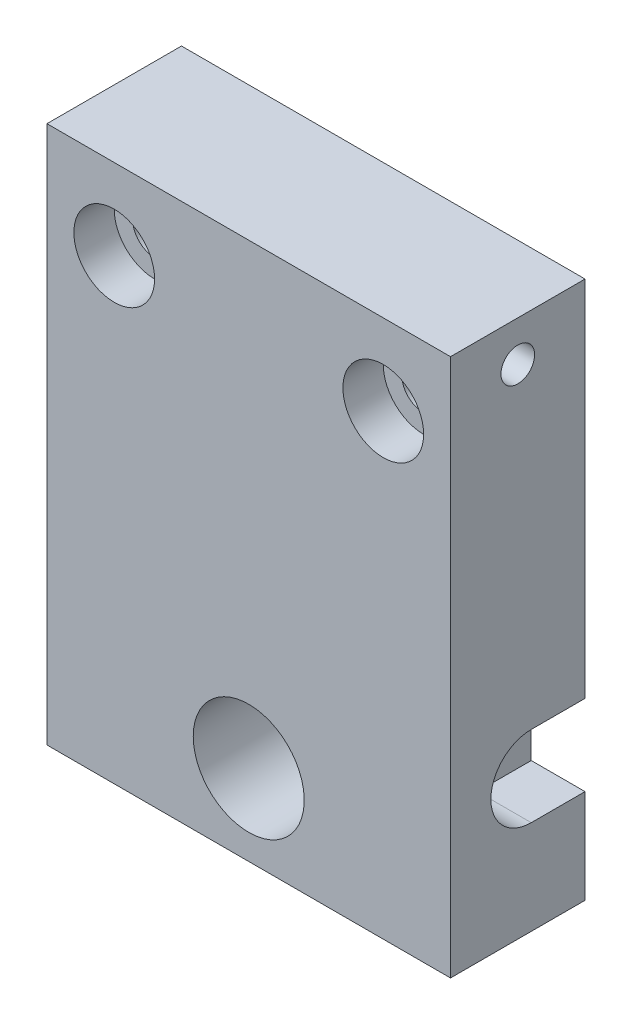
ISO-10303-21;
HEADER;
FILE_DESCRIPTION(('STEP AP214'),'2;1');
FILE_NAME('part.step','',(''),(''),'','','');
FILE_SCHEMA(('AUTOMOTIVE_DESIGN { 1 0 10303 214 1 1 1 1 }'));
ENDSEC;
DATA;
#1=APPLICATION_CONTEXT('core data for automotive mechanical design processes');
#2=APPLICATION_PROTOCOL_DEFINITION('international standard','automotive_design',2000,#1);
#3=PRODUCT_CONTEXT('',#1,'mechanical');
#4=PRODUCT('Part','Part','',(#3));
#5=PRODUCT_RELATED_PRODUCT_CATEGORY('part','',(#4));
#6=PRODUCT_DEFINITION_FORMATION('','',#4);
#7=PRODUCT_DEFINITION_CONTEXT('part definition',#1,'design');
#8=PRODUCT_DEFINITION('design','',#6,#7);
#9=PRODUCT_DEFINITION_SHAPE('','',#8);
#10=(LENGTH_UNIT() NAMED_UNIT(*) SI_UNIT(.MILLI.,.METRE.));
#11=(NAMED_UNIT(*) PLANE_ANGLE_UNIT() SI_UNIT($,.RADIAN.));
#12=(NAMED_UNIT(*) SI_UNIT($,.STERADIAN.) SOLID_ANGLE_UNIT());
#13=UNCERTAINTY_MEASURE_WITH_UNIT(LENGTH_MEASURE(1.E-05),#10,'distance_accuracy_value','');
#14=(GEOMETRIC_REPRESENTATION_CONTEXT(3) GLOBAL_UNCERTAINTY_ASSIGNED_CONTEXT((#13)) GLOBAL_UNIT_ASSIGNED_CONTEXT((#10,
#11,#12)) REPRESENTATION_CONTEXT('',''));
#15=CARTESIAN_POINT('',(0.,0.,0.));
#16=DIRECTION('',(0.,0.,1.));
#17=DIRECTION('',(1.,0.,0.));
#18=AXIS2_PLACEMENT_3D('',#15,#16,#17);
#19=CARTESIAN_POINT('',(-30.,80.,-4.71844785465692E-13));
#20=DIRECTION('',(1.,0.,0.));
#21=DIRECTION('',(0.,0.,-1.));
#22=AXIS2_PLACEMENT_3D('',#19,#20,#21);
#23=PLANE('',#22);
#24=CARTESIAN_POINT('',(-30.,74.,-10.0000000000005));
#25=DIRECTION('',(-1.,0.,0.));
#26=DIRECTION('',(0.,0.,1.));
#27=AXIS2_PLACEMENT_3D('',#24,#25,#26);
#28=CIRCLE('',#27,2.49999999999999);
#29=CARTESIAN_POINT('',(-30.,74.,-7.50000000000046));
#30=VERTEX_POINT('',#29);
#31=EDGE_CURVE('E169',#30,#30,#28,.T.);
#32=ORIENTED_EDGE('',*,*,#31,.F.);
#33=EDGE_LOOP('',(#32));
#34=FACE_BOUND('',#33,.T.);
#35=DIRECTION('',(0.,0.,1.));
#36=VECTOR('',#35,1.);
#37=CARTESIAN_POINT('',(-30.,0.,0.));
#38=LINE('',#37,#36);
#39=CARTESIAN_POINT('',(-30.,0.,-20.));
#40=VERTEX_POINT('',#39);
#41=CARTESIAN_POINT('',(-30.,0.,0.));
#42=VERTEX_POINT('',#41);
#43=EDGE_CURVE('E213',#40,#42,#38,.T.);
#44=ORIENTED_EDGE('',*,*,#43,.T.);
#45=DIRECTION('',(0.,-1.,0.));
#46=VECTOR('',#45,1.);
#47=CARTESIAN_POINT('',(-30.,80.,-4.71844785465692E-13));
#48=LINE('',#47,#46);
#49=CARTESIAN_POINT('',(-30.,80.,-4.71844785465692E-13));
#50=VERTEX_POINT('',#49);
#51=EDGE_CURVE('E11',#50,#42,#48,.T.);
#52=ORIENTED_EDGE('',*,*,#51,.F.);
#53=DIRECTION('',(0.,0.,1.));
#54=VECTOR('',#53,1.);
#55=CARTESIAN_POINT('',(-30.,80.,-4.71844785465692E-13));
#56=LINE('',#55,#54);
#57=CARTESIAN_POINT('',(-30.,80.,-20.));
#58=VERTEX_POINT('',#57);
#59=EDGE_CURVE('E226',#58,#50,#56,.T.);
#60=ORIENTED_EDGE('',*,*,#59,.F.);
#61=DIRECTION('',(0.,-1.,0.));
#62=VECTOR('',#61,1.);
#63=CARTESIAN_POINT('',(-30.,80.,-20.));
#64=LINE('',#63,#62);
#65=EDGE_CURVE('E237',#58,#40,#64,.T.);
#66=ORIENTED_EDGE('',*,*,#65,.T.);
#67=EDGE_LOOP('',(#44,#52,#60,#66));
#68=FACE_BOUND('',#67,.T.);
#69=ADVANCED_FACE('F42',(#34,#68),#23,.F.);
#70=CARTESIAN_POINT('',(-30.,80.,-4.71844785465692E-13));
#71=DIRECTION('',(0.,0.,-1.));
#72=DIRECTION('',(-1.,0.,0.));
#73=AXIS2_PLACEMENT_3D('',#70,#71,#72);
#74=PLANE('',#73);
#75=CARTESIAN_POINT('',(0.,12.,0.));
#76=DIRECTION('',(0.,0.,-1.));
#77=DIRECTION('',(-1.,0.,0.));
#78=AXIS2_PLACEMENT_3D('',#75,#76,#77);
#79=CIRCLE('',#78,8.24999999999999);
#80=CARTESIAN_POINT('',(-8.24999999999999,12.,0.));
#81=VERTEX_POINT('',#80);
#82=EDGE_CURVE('E133',#81,#81,#79,.T.);
#83=ORIENTED_EDGE('',*,*,#82,.T.);
#84=EDGE_LOOP('',(#83));
#85=FACE_BOUND('',#84,.T.);
#86=CARTESIAN_POINT('',(-20.,67.9999999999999,0.));
#87=DIRECTION('',(0.,0.,1.));
#88=DIRECTION('',(1.,0.,0.));
#89=AXIS2_PLACEMENT_3D('',#86,#87,#88);
#90=CIRCLE('',#89,5.99999999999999);
#91=CARTESIAN_POINT('',(-14.,67.9999999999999,0.));
#92=VERTEX_POINT('',#91);
#93=EDGE_CURVE('E181',#92,#92,#90,.T.);
#94=ORIENTED_EDGE('',*,*,#93,.F.);
#95=EDGE_LOOP('',(#94));
#96=FACE_BOUND('',#95,.T.);
#97=CARTESIAN_POINT('',(20.,67.9999999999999,0.));
#98=DIRECTION('',(0.,0.,1.));
#99=DIRECTION('',(1.,0.,0.));
#100=AXIS2_PLACEMENT_3D('',#97,#98,#99);
#101=CIRCLE('',#100,5.99999999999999);
#102=CARTESIAN_POINT('',(26.,67.9999999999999,0.));
#103=VERTEX_POINT('',#102);
#104=EDGE_CURVE('E197',#103,#103,#101,.T.);
#105=ORIENTED_EDGE('',*,*,#104,.F.);
#106=EDGE_LOOP('',(#105));
#107=FACE_BOUND('',#106,.T.);
#108=DIRECTION('',(1.,0.,0.));
#109=VECTOR('',#108,1.);
#110=CARTESIAN_POINT('',(-30.,0.,0.));
#111=LINE('',#110,#109);
#112=CARTESIAN_POINT('',(29.9999999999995,0.,0.));
#113=VERTEX_POINT('',#112);
#114=EDGE_CURVE('E217',#42,#113,#111,.T.);
#115=ORIENTED_EDGE('',*,*,#114,.T.);
#116=DIRECTION('',(0.,-1.,0.));
#117=VECTOR('',#116,1.);
#118=CARTESIAN_POINT('',(30.,80.,0.));
#119=LINE('',#118,#117);
#120=CARTESIAN_POINT('',(30.,80.,0.));
#121=VERTEX_POINT('',#120);
#122=EDGE_CURVE('E50',#121,#113,#119,.T.);
#123=ORIENTED_EDGE('',*,*,#122,.F.);
#124=DIRECTION('',(1.,0.,0.));
#125=VECTOR('',#124,1.);
#126=CARTESIAN_POINT('',(-30.,80.,-4.71844785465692E-13));
#127=LINE('',#126,#125);
#128=EDGE_CURVE('E229',#50,#121,#127,.T.);
#129=ORIENTED_EDGE('',*,*,#128,.F.);
#130=ORIENTED_EDGE('',*,*,#51,.T.);
#131=EDGE_LOOP('',(#115,#123,#129,#130));
#132=FACE_BOUND('',#131,.T.);
#133=ADVANCED_FACE('F262',(#85,#96,#107,#132),#74,.F.);
#134=CARTESIAN_POINT('',(30.,80.,0.));
#135=DIRECTION('',(-1.,0.,0.));
#136=DIRECTION('',(0.,0.,1.));
#137=AXIS2_PLACEMENT_3D('',#134,#135,#136);
#138=PLANE('',#137);
#139=CARTESIAN_POINT('',(30.,74.,-9.99999999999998));
#140=DIRECTION('',(1.,0.,0.));
#141=DIRECTION('',(0.,0.,-1.));
#142=AXIS2_PLACEMENT_3D('',#139,#140,#141);
#143=CIRCLE('',#142,2.5);
#144=CARTESIAN_POINT('',(30.,74.,-12.5));
#145=VERTEX_POINT('',#144);
#146=EDGE_CURVE('E177',#145,#145,#143,.T.);
#147=ORIENTED_EDGE('',*,*,#146,.F.);
#148=EDGE_LOOP('',(#147));
#149=FACE_BOUND('',#148,.T.);
#150=CARTESIAN_POINT('',(30.,20.,-12.));
#151=DIRECTION('',(1.,0.,0.));
#152=DIRECTION('',(0.,0.,-1.));
#153=AXIS2_PLACEMENT_3D('',#150,#151,#152);
#154=CIRCLE('',#153,6.);
#155=CARTESIAN_POINT('',(29.9999999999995,26.,-12.));
#156=VERTEX_POINT('',#155);
#157=CARTESIAN_POINT('',(30.,14.,-12.));
#158=VERTEX_POINT('',#157);
#159=EDGE_CURVE('E126',#156,#158,#154,.T.);
#160=ORIENTED_EDGE('',*,*,#159,.F.);
#161=DIRECTION('',(0.,0.,1.));
#162=VECTOR('',#161,1.);
#163=CARTESIAN_POINT('',(29.9999999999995,26.,-12.));
#164=LINE('',#163,#162);
#165=CARTESIAN_POINT('',(29.9999999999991,26.,-20.));
#166=VERTEX_POINT('',#165);
#167=EDGE_CURVE('E140',#166,#156,#164,.T.);
#168=ORIENTED_EDGE('',*,*,#167,.F.);
#169=DIRECTION('',(0.,-1.,0.));
#170=VECTOR('',#169,1.);
#171=CARTESIAN_POINT('',(29.9999999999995,80.,-20.));
#172=LINE('',#171,#170);
#173=CARTESIAN_POINT('',(29.9999999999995,80.,-20.));
#174=VERTEX_POINT('',#173);
#175=EDGE_CURVE('E241',#174,#166,#172,.T.);
#176=ORIENTED_EDGE('',*,*,#175,.F.);
#177=DIRECTION('',(0.,0.,-1.));
#178=VECTOR('',#177,1.);
#179=CARTESIAN_POINT('',(30.,80.,0.));
#180=LINE('',#179,#178);
#181=EDGE_CURVE('E232',#121,#174,#180,.T.);
#182=ORIENTED_EDGE('',*,*,#181,.F.);
#183=ORIENTED_EDGE('',*,*,#122,.T.);
#184=DIRECTION('',(0.,0.,-1.));
#185=VECTOR('',#184,1.);
#186=CARTESIAN_POINT('',(29.9999999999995,0.,0.));
#187=LINE('',#186,#185);
#188=CARTESIAN_POINT('',(29.9999999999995,0.,-20.));
#189=VERTEX_POINT('',#188);
#190=EDGE_CURVE('E220',#113,#189,#187,.T.);
#191=ORIENTED_EDGE('',*,*,#190,.T.);
#192=CARTESIAN_POINT('',(29.9999999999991,14.,-20.));
#193=VERTEX_POINT('',#192);
#194=EDGE_CURVE('E138',#193,#189,#172,.T.);
#195=ORIENTED_EDGE('',*,*,#194,.F.);
#196=DIRECTION('',(0.,0.,-1.));
#197=VECTOR('',#196,1.);
#198=CARTESIAN_POINT('',(29.9999999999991,14.,-20.));
#199=LINE('',#198,#197);
#200=EDGE_CURVE('E117',#158,#193,#199,.T.);
#201=ORIENTED_EDGE('',*,*,#200,.F.);
#202=EDGE_LOOP('',(#160,#168,#176,#182,#183,#191,#195,#201));
#203=FACE_BOUND('',#202,.T.);
#204=ADVANCED_FACE('F136',(#149,#203),#138,.F.);
#205=CARTESIAN_POINT('',(-30.,80.,-20.));
#206=DIRECTION('',(0.,0.,1.));
#207=DIRECTION('',(1.,0.,0.));
#208=AXIS2_PLACEMENT_3D('',#205,#206,#207);
#209=PLANE('',#208);
#210=CARTESIAN_POINT('',(0.,12.,-20.));
#211=DIRECTION('',(0.,0.,-1.));
#212=DIRECTION('',(-1.,0.,0.));
#213=AXIS2_PLACEMENT_3D('',#210,#211,#212);
#214=CIRCLE('',#213,8.24999999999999);
#215=CARTESIAN_POINT('',(-8.24999999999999,12.,-20.));
#216=VERTEX_POINT('',#215);
#217=EDGE_CURVE('E341',#216,#216,#214,.T.);
#218=ORIENTED_EDGE('',*,*,#217,.F.);
#219=EDGE_LOOP('',(#218));
#220=FACE_BOUND('',#219,.T.);
#221=ORIENTED_EDGE('',*,*,#175,.T.);
#222=DIRECTION('',(1.,0.,0.));
#223=VECTOR('',#222,1.);
#224=CARTESIAN_POINT('',(22.,26.,-20.));
#225=LINE('',#224,#223);
#226=CARTESIAN_POINT('',(22.,26.,-20.));
#227=VERTEX_POINT('',#226);
#228=EDGE_CURVE('E161',#227,#166,#225,.T.);
#229=ORIENTED_EDGE('',*,*,#228,.F.);
#230=DIRECTION('',(0.,1.,0.));
#231=VECTOR('',#230,1.);
#232=CARTESIAN_POINT('',(22.,26.,-20.));
#233=LINE('',#232,#231);
#234=CARTESIAN_POINT('',(22.,14.,-20.));
#235=VERTEX_POINT('',#234);
#236=EDGE_CURVE('E152',#235,#227,#233,.T.);
#237=ORIENTED_EDGE('',*,*,#236,.F.);
#238=DIRECTION('',(1.,0.,0.));
#239=VECTOR('',#238,1.);
#240=CARTESIAN_POINT('',(22.,14.,-20.));
#241=LINE('',#240,#239);
#242=EDGE_CURVE('E122',#235,#193,#241,.T.);
#243=ORIENTED_EDGE('',*,*,#242,.T.);
#244=ORIENTED_EDGE('',*,*,#194,.T.);
#245=DIRECTION('',(-1.,0.,0.));
#246=VECTOR('',#245,1.);
#247=CARTESIAN_POINT('',(-30.,0.,-20.));
#248=LINE('',#247,#246);
#249=EDGE_CURVE('E223',#189,#40,#248,.T.);
#250=ORIENTED_EDGE('',*,*,#249,.T.);
#251=ORIENTED_EDGE('',*,*,#65,.F.);
#252=DIRECTION('',(-1.,0.,0.));
#253=VECTOR('',#252,1.);
#254=CARTESIAN_POINT('',(-30.,80.,-20.));
#255=LINE('',#254,#253);
#256=EDGE_CURVE('E65',#174,#58,#255,.T.);
#257=ORIENTED_EDGE('',*,*,#256,.F.);
#258=EDGE_LOOP('',(#221,#229,#237,#243,#244,#250,#251,#257));
#259=FACE_BOUND('',#258,.T.);
#260=CARTESIAN_POINT('',(-20.,67.9999999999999,-20.));
#261=DIRECTION('',(0.,0.,1.));
#262=DIRECTION('',(1.,0.,0.));
#263=AXIS2_PLACEMENT_3D('',#260,#261,#262);
#264=CIRCLE('',#263,3.25);
#265=CARTESIAN_POINT('',(-16.75,67.9999999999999,-20.));
#266=VERTEX_POINT('',#265);
#267=EDGE_CURVE('E193',#266,#266,#264,.T.);
#268=ORIENTED_EDGE('',*,*,#267,.T.);
#269=EDGE_LOOP('',(#268));
#270=FACE_BOUND('',#269,.T.);
#271=CARTESIAN_POINT('',(20.,67.9999999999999,-20.));
#272=DIRECTION('',(0.,0.,1.));
#273=DIRECTION('',(1.,0.,0.));
#274=AXIS2_PLACEMENT_3D('',#271,#272,#273);
#275=CIRCLE('',#274,3.25);
#276=CARTESIAN_POINT('',(23.25,67.9999999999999,-20.));
#277=VERTEX_POINT('',#276);
#278=EDGE_CURVE('E209',#277,#277,#275,.T.);
#279=ORIENTED_EDGE('',*,*,#278,.T.);
#280=EDGE_LOOP('',(#279));
#281=FACE_BOUND('',#280,.T.);
#282=ADVANCED_FACE('F256',(#220,#259,#270,#281),#209,.F.);
#283=CARTESIAN_POINT('',(-30.,80.,-20.));
#284=DIRECTION('',(0.,-1.,0.));
#285=DIRECTION('',(0.,0.,-1.));
#286=AXIS2_PLACEMENT_3D('',#283,#284,#285);
#287=PLANE('',#286);
#288=ORIENTED_EDGE('',*,*,#59,.T.);
#289=ORIENTED_EDGE('',*,*,#128,.T.);
#290=ORIENTED_EDGE('',*,*,#181,.T.);
#291=ORIENTED_EDGE('',*,*,#256,.T.);
#292=EDGE_LOOP('',(#288,#289,#290,#291));
#293=FACE_BOUND('',#292,.T.);
#294=ADVANCED_FACE('F261',(#293),#287,.F.);
#295=CARTESIAN_POINT('',(-30.,0.,-20.));
#296=DIRECTION('',(0.,-1.,0.));
#297=DIRECTION('',(0.,0.,-1.));
#298=AXIS2_PLACEMENT_3D('',#295,#296,#297);
#299=PLANE('',#298);
#300=ORIENTED_EDGE('',*,*,#43,.F.);
#301=ORIENTED_EDGE('',*,*,#249,.F.);
#302=ORIENTED_EDGE('',*,*,#190,.F.);
#303=ORIENTED_EDGE('',*,*,#114,.F.);
#304=EDGE_LOOP('',(#300,#301,#302,#303));
#305=FACE_BOUND('',#304,.T.);
#306=ADVANCED_FACE('F254',(#305),#299,.T.);
#307=CARTESIAN_POINT('',(20.,67.9999999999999,0.));
#308=DIRECTION('',(0.,0.,1.));
#309=DIRECTION('',(1.,0.,0.));
#310=AXIS2_PLACEMENT_3D('',#307,#308,#309);
#311=CYLINDRICAL_SURFACE('',#310,3.25);
#312=ORIENTED_EDGE('',*,*,#278,.F.);
#313=EDGE_LOOP('',(#312));
#314=FACE_BOUND('',#313,.T.);
#315=CARTESIAN_POINT('',(20.,67.9999999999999,-6.00000000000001));
#316=DIRECTION('',(0.,0.,1.));
#317=DIRECTION('',(1.,0.,0.));
#318=AXIS2_PLACEMENT_3D('',#315,#316,#317);
#319=CIRCLE('',#318,3.25);
#320=CARTESIAN_POINT('',(23.25,67.9999999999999,-6.00000000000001));
#321=VERTEX_POINT('',#320);
#322=EDGE_CURVE('E205',#321,#321,#319,.T.);
#323=ORIENTED_EDGE('',*,*,#322,.T.);
#324=EDGE_LOOP('',(#323));
#325=FACE_BOUND('',#324,.T.);
#326=ADVANCED_FACE('F282',(#314,#325),#311,.F.);
#327=CARTESIAN_POINT('',(23.25,67.9999999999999,-6.00000000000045));
#328=DIRECTION('',(0.,0.,-1.));
#329=DIRECTION('',(-1.,0.,0.));
#330=AXIS2_PLACEMENT_3D('',#327,#328,#329);
#331=PLANE('',#330);
#332=ORIENTED_EDGE('',*,*,#322,.F.);
#333=EDGE_LOOP('',(#332));
#334=FACE_BOUND('',#333,.T.);
#335=CARTESIAN_POINT('',(20.,67.9999999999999,-6.00000000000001));
#336=DIRECTION('',(0.,0.,1.));
#337=DIRECTION('',(1.,0.,0.));
#338=AXIS2_PLACEMENT_3D('',#335,#336,#337);
#339=CIRCLE('',#338,6.);
#340=CARTESIAN_POINT('',(26.,67.9999999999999,-6.00000000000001));
#341=VERTEX_POINT('',#340);
#342=EDGE_CURVE('E201',#341,#341,#339,.T.);
#343=ORIENTED_EDGE('',*,*,#342,.T.);
#344=EDGE_LOOP('',(#343));
#345=FACE_BOUND('',#344,.T.);
#346=ADVANCED_FACE('F285',(#334,#345),#331,.F.);
#347=CARTESIAN_POINT('',(20.,67.9999999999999,0.));
#348=DIRECTION('',(0.,0.,1.));
#349=DIRECTION('',(1.,0.,0.));
#350=AXIS2_PLACEMENT_3D('',#347,#348,#349);
#351=CYLINDRICAL_SURFACE('',#350,6.);
#352=ORIENTED_EDGE('',*,*,#342,.F.);
#353=EDGE_LOOP('',(#352));
#354=FACE_BOUND('',#353,.T.);
#355=ORIENTED_EDGE('',*,*,#104,.T.);
#356=EDGE_LOOP('',(#355));
#357=FACE_BOUND('',#356,.T.);
#358=ADVANCED_FACE('F289',(#354,#357),#351,.F.);
#359=CARTESIAN_POINT('',(-20.,67.9999999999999,0.));
#360=DIRECTION('',(0.,0.,1.));
#361=DIRECTION('',(1.,0.,0.));
#362=AXIS2_PLACEMENT_3D('',#359,#360,#361);
#363=CYLINDRICAL_SURFACE('',#362,3.25);
#364=ORIENTED_EDGE('',*,*,#267,.F.);
#365=EDGE_LOOP('',(#364));
#366=FACE_BOUND('',#365,.T.);
#367=CARTESIAN_POINT('',(-20.,67.9999999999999,-6.00000000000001));
#368=DIRECTION('',(0.,0.,1.));
#369=DIRECTION('',(1.,0.,0.));
#370=AXIS2_PLACEMENT_3D('',#367,#368,#369);
#371=CIRCLE('',#370,3.25);
#372=CARTESIAN_POINT('',(-16.75,67.9999999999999,-6.00000000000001));
#373=VERTEX_POINT('',#372);
#374=EDGE_CURVE('E189',#373,#373,#371,.T.);
#375=ORIENTED_EDGE('',*,*,#374,.T.);
#376=EDGE_LOOP('',(#375));
#377=FACE_BOUND('',#376,.T.);
#378=ADVANCED_FACE('F293',(#366,#377),#363,.F.);
#379=CARTESIAN_POINT('',(-16.75,67.9999999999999,-6.00000000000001));
#380=DIRECTION('',(0.,0.,-1.));
#381=DIRECTION('',(-1.,0.,0.));
#382=AXIS2_PLACEMENT_3D('',#379,#380,#381);
#383=PLANE('',#382);
#384=ORIENTED_EDGE('',*,*,#374,.F.);
#385=EDGE_LOOP('',(#384));
#386=FACE_BOUND('',#385,.T.);
#387=CARTESIAN_POINT('',(-20.,67.9999999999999,-6.00000000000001));
#388=DIRECTION('',(0.,0.,1.));
#389=DIRECTION('',(1.,0.,0.));
#390=AXIS2_PLACEMENT_3D('',#387,#388,#389);
#391=CIRCLE('',#390,6.);
#392=CARTESIAN_POINT('',(-14.,67.9999999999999,-6.00000000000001));
#393=VERTEX_POINT('',#392);
#394=EDGE_CURVE('E185',#393,#393,#391,.T.);
#395=ORIENTED_EDGE('',*,*,#394,.T.);
#396=EDGE_LOOP('',(#395));
#397=FACE_BOUND('',#396,.T.);
#398=ADVANCED_FACE('F297',(#386,#397),#383,.F.);
#399=CARTESIAN_POINT('',(-20.,67.9999999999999,0.));
#400=DIRECTION('',(0.,0.,1.));
#401=DIRECTION('',(1.,0.,0.));
#402=AXIS2_PLACEMENT_3D('',#399,#400,#401);
#403=CYLINDRICAL_SURFACE('',#402,6.);
#404=ORIENTED_EDGE('',*,*,#394,.F.);
#405=EDGE_LOOP('',(#404));
#406=FACE_BOUND('',#405,.T.);
#407=ORIENTED_EDGE('',*,*,#93,.T.);
#408=EDGE_LOOP('',(#407));
#409=FACE_BOUND('',#408,.T.);
#410=ADVANCED_FACE('F301',(#406,#409),#403,.F.);
#411=CARTESIAN_POINT('',(30.,74.,-9.99999999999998));
#412=DIRECTION('',(1.,0.,0.));
#413=DIRECTION('',(0.,0.,-1.));
#414=AXIS2_PLACEMENT_3D('',#411,#412,#413);
#415=CYLINDRICAL_SURFACE('',#414,2.5);
#416=CARTESIAN_POINT('',(13.9999999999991,74.,-10.));
#417=DIRECTION('',(1.,0.,0.));
#418=DIRECTION('',(0.,0.,-1.));
#419=AXIS2_PLACEMENT_3D('',#416,#417,#418);
#420=CIRCLE('',#419,2.5);
#421=CARTESIAN_POINT('',(13.9999999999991,74.,-12.5));
#422=VERTEX_POINT('',#421);
#423=EDGE_CURVE('E173',#422,#422,#420,.T.);
#424=ORIENTED_EDGE('',*,*,#423,.F.);
#425=EDGE_LOOP('',(#424));
#426=FACE_BOUND('',#425,.T.);
#427=ORIENTED_EDGE('',*,*,#146,.T.);
#428=EDGE_LOOP('',(#427));
#429=FACE_BOUND('',#428,.T.);
#430=ADVANCED_FACE('F305',(#426,#429),#415,.F.);
#431=CARTESIAN_POINT('',(13.9999999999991,74.,-10.));
#432=DIRECTION('',(1.,0.,0.));
#433=DIRECTION('',(0.,0.,-1.));
#434=AXIS2_PLACEMENT_3D('',#431,#432,#433);
#435=CONICAL_SURFACE('',#434,2.5,1.02974425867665);
#436=CARTESIAN_POINT('',(12.4978484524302,74.,-10.));
#437=VERTEX_POINT('',#436);
#438=VERTEX_LOOP('',#437);
#439=FACE_BOUND('',#438,.T.);
#440=ORIENTED_EDGE('',*,*,#423,.T.);
#441=EDGE_LOOP('',(#440));
#442=FACE_BOUND('',#441,.T.);
#443=ADVANCED_FACE('F309',(#439,#442),#435,.F.);
#444=CARTESIAN_POINT('',(-30.,74.,-10.0000000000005));
#445=DIRECTION('',(-1.,0.,0.));
#446=DIRECTION('',(0.,0.,1.));
#447=AXIS2_PLACEMENT_3D('',#444,#445,#446);
#448=CYLINDRICAL_SURFACE('',#447,2.49999999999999);
#449=CARTESIAN_POINT('',(-14.0000000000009,74.,-10.));
#450=DIRECTION('',(-1.,0.,0.));
#451=DIRECTION('',(0.,0.,1.));
#452=AXIS2_PLACEMENT_3D('',#449,#450,#451);
#453=CIRCLE('',#452,2.49999999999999);
#454=CARTESIAN_POINT('',(-14.0000000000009,74.,-7.50000000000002));
#455=VERTEX_POINT('',#454);
#456=EDGE_CURVE('E160',#455,#455,#453,.T.);
#457=ORIENTED_EDGE('',*,*,#456,.F.);
#458=EDGE_LOOP('',(#457));
#459=FACE_BOUND('',#458,.T.);
#460=ORIENTED_EDGE('',*,*,#31,.T.);
#461=EDGE_LOOP('',(#460));
#462=FACE_BOUND('',#461,.T.);
#463=ADVANCED_FACE('F313',(#459,#462),#448,.F.);
#464=CARTESIAN_POINT('',(-14.0000000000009,74.,-10.));
#465=DIRECTION('',(-1.,0.,0.));
#466=DIRECTION('',(0.,0.,1.));
#467=AXIS2_PLACEMENT_3D('',#464,#465,#466);
#468=CONICAL_SURFACE('',#467,2.49999999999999,1.02974425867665);
#469=CARTESIAN_POINT('',(-12.497848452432,74.,-10.));
#470=VERTEX_POINT('',#469);
#471=VERTEX_LOOP('',#470);
#472=FACE_BOUND('',#471,.T.);
#473=ORIENTED_EDGE('',*,*,#456,.T.);
#474=EDGE_LOOP('',(#473));
#475=FACE_BOUND('',#474,.T.);
#476=ADVANCED_FACE('F317',(#472,#475),#468,.F.);
#477=CARTESIAN_POINT('',(22.,20.,-12.));
#478=DIRECTION('',(1.,0.,0.));
#479=DIRECTION('',(0.,0.,-1.));
#480=AXIS2_PLACEMENT_3D('',#477,#478,#479);
#481=CYLINDRICAL_SURFACE('',#480,6.);
#482=ORIENTED_EDGE('',*,*,#159,.T.);
#483=DIRECTION('',(1.,0.,0.));
#484=VECTOR('',#483,1.);
#485=CARTESIAN_POINT('',(22.,14.,-12.));
#486=LINE('',#485,#484);
#487=CARTESIAN_POINT('',(22.,14.,-12.));
#488=VERTEX_POINT('',#487);
#489=EDGE_CURVE('E113',#488,#158,#486,.T.);
#490=ORIENTED_EDGE('',*,*,#489,.F.);
#491=CARTESIAN_POINT('',(22.,20.,-12.));
#492=DIRECTION('',(1.,0.,0.));
#493=DIRECTION('',(0.,0.,-1.));
#494=AXIS2_PLACEMENT_3D('',#491,#492,#493);
#495=CIRCLE('',#494,6.);
#496=CARTESIAN_POINT('',(22.,26.,-12.));
#497=VERTEX_POINT('',#496);
#498=EDGE_CURVE('E144',#497,#488,#495,.T.);
#499=ORIENTED_EDGE('',*,*,#498,.F.);
#500=DIRECTION('',(1.,0.,0.));
#501=VECTOR('',#500,1.);
#502=CARTESIAN_POINT('',(22.,26.,-12.));
#503=LINE('',#502,#501);
#504=EDGE_CURVE('E128',#497,#156,#503,.T.);
#505=ORIENTED_EDGE('',*,*,#504,.T.);
#506=EDGE_LOOP('',(#482,#490,#499,#505));
#507=FACE_BOUND('',#506,.T.);
#508=ADVANCED_FACE('F127',(#507),#481,.F.);
#509=CARTESIAN_POINT('',(22.,26.,-12.));
#510=DIRECTION('',(0.,1.,0.));
#511=DIRECTION('',(0.,0.,1.));
#512=AXIS2_PLACEMENT_3D('',#509,#510,#511);
#513=PLANE('',#512);
#514=ORIENTED_EDGE('',*,*,#167,.T.);
#515=ORIENTED_EDGE('',*,*,#504,.F.);
#516=DIRECTION('',(0.,0.,1.));
#517=VECTOR('',#516,1.);
#518=CARTESIAN_POINT('',(22.,26.,-12.));
#519=LINE('',#518,#517);
#520=EDGE_CURVE('E123',#227,#497,#519,.T.);
#521=ORIENTED_EDGE('',*,*,#520,.F.);
#522=ORIENTED_EDGE('',*,*,#228,.T.);
#523=EDGE_LOOP('',(#514,#515,#521,#522));
#524=FACE_BOUND('',#523,.T.);
#525=ADVANCED_FACE('F324',(#524),#513,.F.);
#526=CARTESIAN_POINT('',(22.,14.,-20.));
#527=DIRECTION('',(0.,-1.,0.));
#528=DIRECTION('',(0.,0.,-1.));
#529=AXIS2_PLACEMENT_3D('',#526,#527,#528);
#530=PLANE('',#529);
#531=ORIENTED_EDGE('',*,*,#200,.T.);
#532=ORIENTED_EDGE('',*,*,#242,.F.);
#533=DIRECTION('',(0.,0.,-1.));
#534=VECTOR('',#533,1.);
#535=CARTESIAN_POINT('',(22.,14.,-20.));
#536=LINE('',#535,#534);
#537=EDGE_CURVE('E57',#488,#235,#536,.T.);
#538=ORIENTED_EDGE('',*,*,#537,.F.);
#539=ORIENTED_EDGE('',*,*,#489,.T.);
#540=EDGE_LOOP('',(#531,#532,#538,#539));
#541=FACE_BOUND('',#540,.T.);
#542=ADVANCED_FACE('F115',(#541),#530,.F.);
#543=CARTESIAN_POINT('',(22.,20.,-12.));
#544=DIRECTION('',(1.,0.,0.));
#545=DIRECTION('',(0.,0.,-1.));
#546=AXIS2_PLACEMENT_3D('',#543,#544,#545);
#547=PLANE('',#546);
#548=ORIENTED_EDGE('',*,*,#498,.T.);
#549=ORIENTED_EDGE('',*,*,#537,.T.);
#550=ORIENTED_EDGE('',*,*,#236,.T.);
#551=ORIENTED_EDGE('',*,*,#520,.T.);
#552=EDGE_LOOP('',(#548,#549,#550,#551));
#553=FACE_BOUND('',#552,.T.);
#554=ADVANCED_FACE('F327',(#553),#547,.T.);
#555=CARTESIAN_POINT('',(0.,12.,-20.));
#556=DIRECTION('',(0.,0.,-1.));
#557=DIRECTION('',(-1.,0.,0.));
#558=AXIS2_PLACEMENT_3D('',#555,#556,#557);
#559=CYLINDRICAL_SURFACE('',#558,8.24999999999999);
#560=ORIENTED_EDGE('',*,*,#217,.T.);
#561=EDGE_LOOP('',(#560));
#562=FACE_BOUND('',#561,.T.);
#563=ORIENTED_EDGE('',*,*,#82,.F.);
#564=EDGE_LOOP('',(#563));
#565=FACE_BOUND('',#564,.T.);
#566=ADVANCED_FACE('F333',(#562,#565),#559,.F.);
#567=CLOSED_SHELL('',(#69,#133,#204,#282,#294,#306,#326,#346,#358,#378,#398,#410,#430,#443,#463,
#476,#508,#525,#542,#554,#566));
#568=MANIFOLD_SOLID_BREP('B2',#567);
#569=ADVANCED_BREP_SHAPE_REPRESENTATION('',(#18,#568),#14);
#570=SHAPE_DEFINITION_REPRESENTATION(#9,#569);
ENDSEC;
END-ISO-10303-21;
